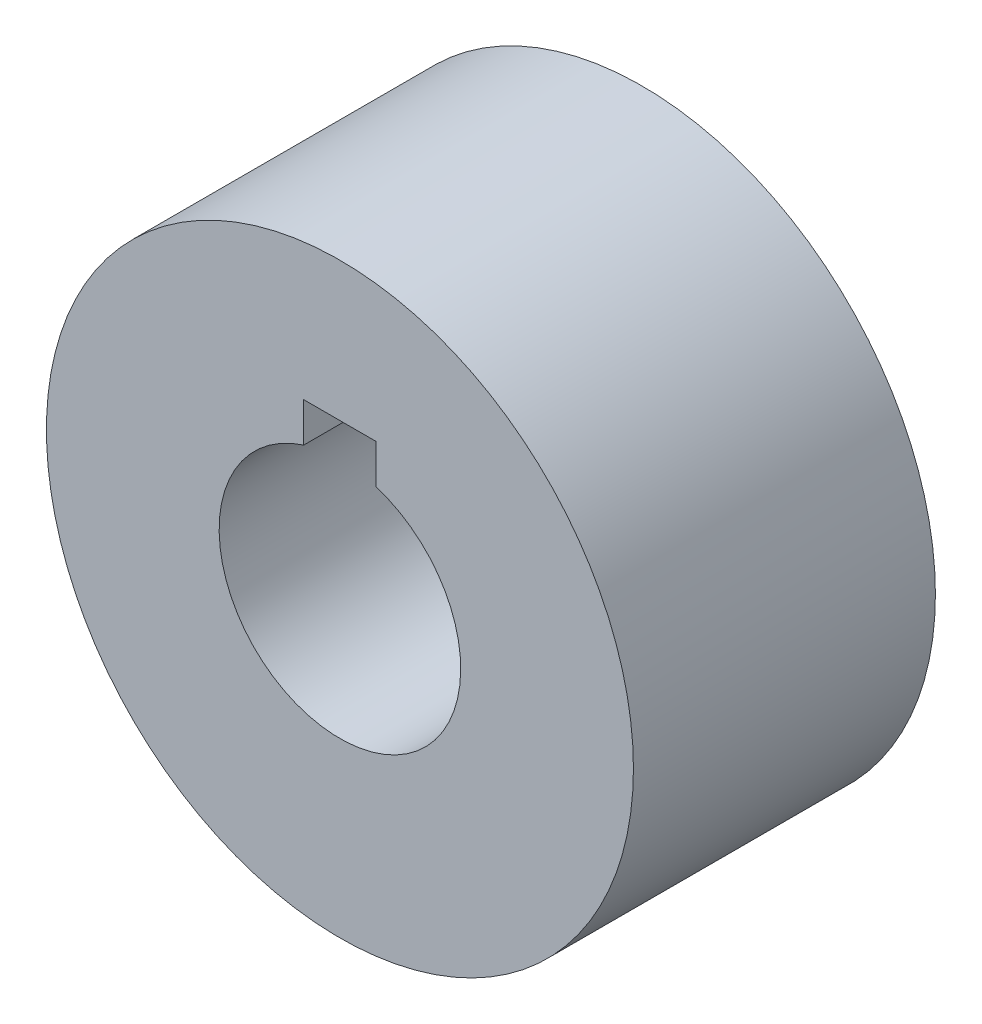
from build123d import *

# Parameters (mm, degrees)
SKIZZE1_R               = 24.3
LINEAR_AUSTRAGEN1_DEPTH = 12.5
BOHRUNG_MIT_NUT_DEPTH   = 50.025997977


with BuildPart() as part:
    # Skizze1 → Linear austragen1 (new, symmetric)
    with BuildSketch(Plane.XY):
        Circle(SKIZZE1_R)
    extrude(amount=LINEAR_AUSTRAGEN1_DEPTH, both=True)

    # Skizze3 → Bohrung mit Nut (cut, through all)
    with BuildSketch(Plane(origin=(-4.187086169, -6.797176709, 12.5), x_dir=(1, 0, 0), z_dir=(0, 0, 1))):
        with BuildLine():
            Line((1.187086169, 16.336568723), (1.187086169, 19.597176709))
            Line((1.187086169, 19.597176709), (7.187086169, 19.597176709))
            Line((7.187086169, 19.597176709), (7.187086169, 16.336568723))
            ThreePointArc((7.187086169, 16.336568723), (4.187086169, -3.202823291), (1.187086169, 16.336568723))
        make_face()
    extrude(amount=-BOHRUNG_MIT_NUT_DEPTH, mode=Mode.SUBTRACT)


solid = part.part
